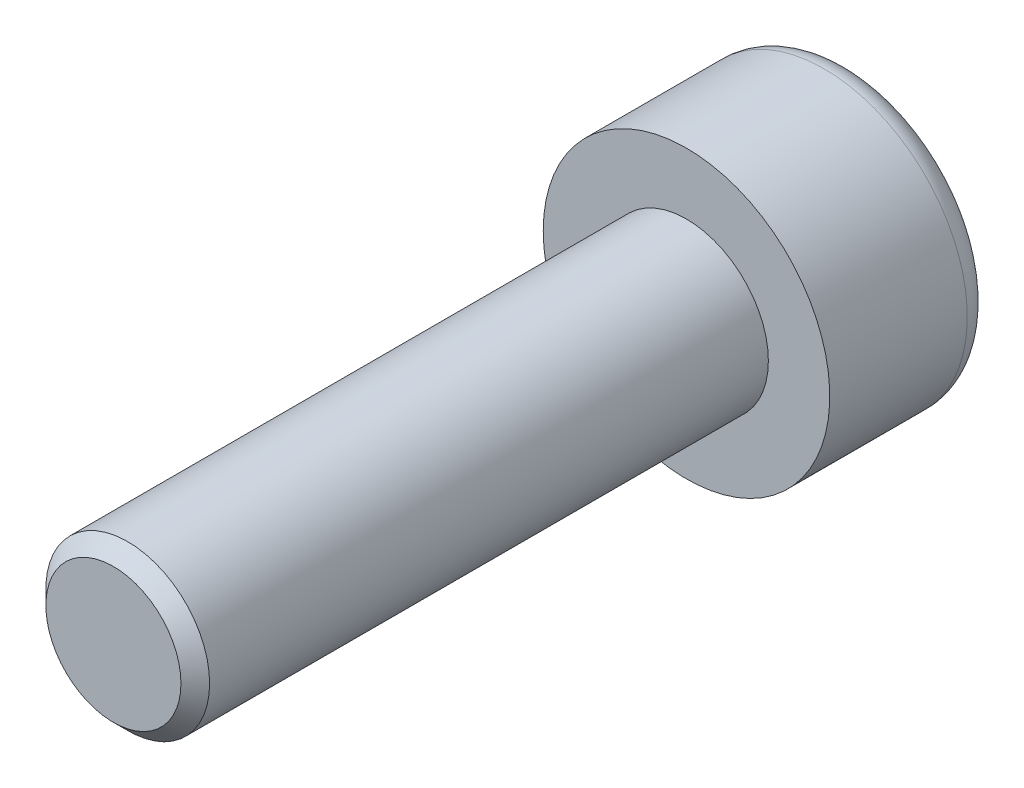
from build123d import *

# Parameters (mm, degrees)
ENLEV_MAT_EXTRU1_DEPTH = 2
ESQUISSE3_W            = 2
ESQUISSE3_H            = 14
CHANFREIN1_SIZE        = 0.35


with BuildPart() as part:
    # Esquisse1 → Base-R_volution (revolve)
    with BuildSketch(Plane(origin=(0, 0, 0), x_dir=(1, 0, 0), z_dir=(0, 1, 0)), mode=Mode.PRIVATE) as base_r_volution_sk:
        with BuildLine():
            Line((0, 0), (3.5, 0))
            Line((3.5, 0), (3.5, 3.36))
            ThreePointArc((3.5, 3.36), (3.31254834, 3.81254834), (2.86, 4))
            Line((2.86, 4), (0, 4))
            Line((0, 4), (0, 0))
        make_face()
    revolve(base_r_volution_sk.sketch.rotate(Axis((0, 0, 0), (0, 0, -1)), 180), axis=Axis((0, 0, 0), (0, 0, -1)))

    # Esquisse2 → enlev-mat-Extru1 (cut)
    with BuildSketch(Plane.XY.offset(-4)):
        Polygon((1.5, -0.866025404), (1.5, 0.866025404), (0, 1.732050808), (-1.5, 0.866025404), (-1.5, -0.866025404), (0, -1.732050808), align=None)
    extrude(amount=ENLEV_MAT_EXTRU1_DEPTH, mode=Mode.SUBTRACT)

    # Esquisse3 → Boss.-R_vol.1 (revolve)
    with BuildSketch(Plane(origin=(0, 0, 0), x_dir=(1, 0, 0), z_dir=(0, 1, 0))):
        with Locations((1, -7)):
            Rectangle(ESQUISSE3_W, ESQUISSE3_H)
    revolve(axis=Axis((0, 0, 0), (0, 0, 1)))

    # Chanfrein1
    chanfrein1_edges = [part.edges().sort_by_distance(p)[0] for p in [
        (-2, 0, 14),
    ]]
    chamfer(chanfrein1_edges, length=CHANFREIN1_SIZE)


solid = part.part
